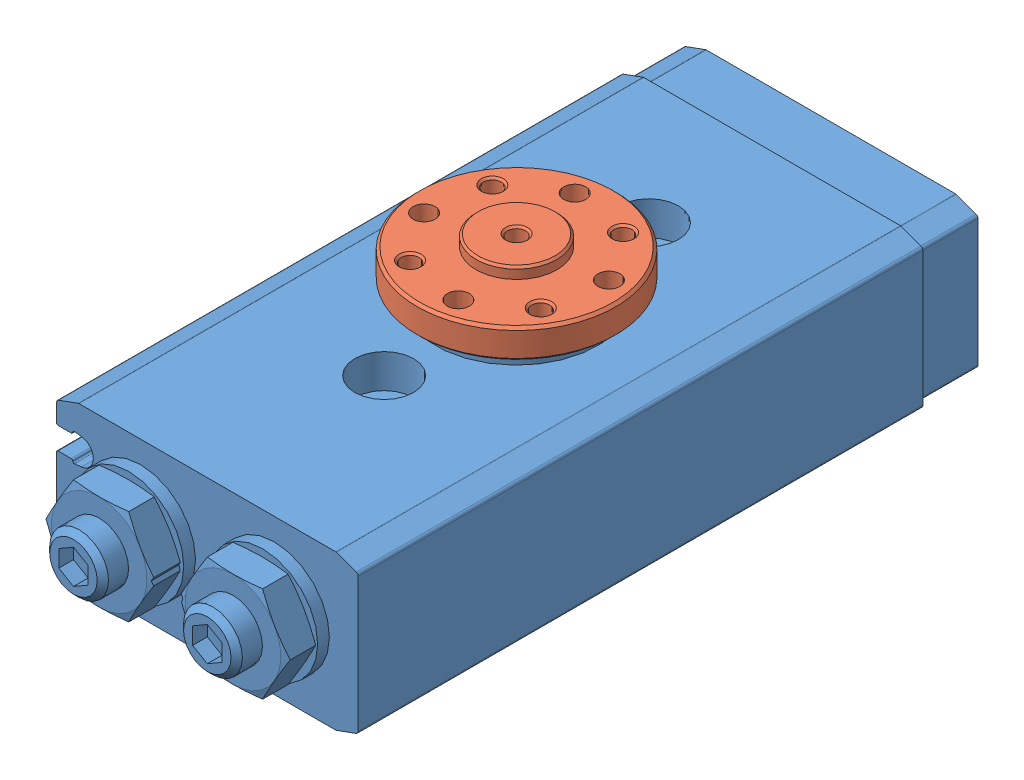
SolidWorks assembly BG.SLDASM, configuration Limit_Bahn (file format 4400). Lengths in mm.
Overall size (68.26 28.7 93.9).
2 component instances, 2 part files, 3 mates.
Components (placement in the parent):
- 11-1: 11.SLDPRT [Standard] at origin size (68.26 28.7 93.9)
- 22-1: 22.SLDPRT [Standard] at (-35.5855 0 -64.4525) x (-0.532759 0 0.846267) z (-0.846267 0 -0.532759) size (43.5 11.9 27)
Mates (geometry in assembly coordinates):
- Konzentrisch2: concentric aligned: cylinder of 11-1 through (0 10.55 -42.05) axis (0 -1 0) radius 5; cylinder of 22-1 through (0 10.5 -42.05) axis (0 -1 0) radius 5
- Deckungsgleich2: coincident anti-aligned: plane of 11-1 through (0 8.3 -45.4) normal (0 1 0); plane of 22-1 through (2.1157 8.3 -40.7181) normal (0 -1 0)
- BahnVerknüpfung1: path: point of 22-1; curve of 11-1; curve of 11-1
